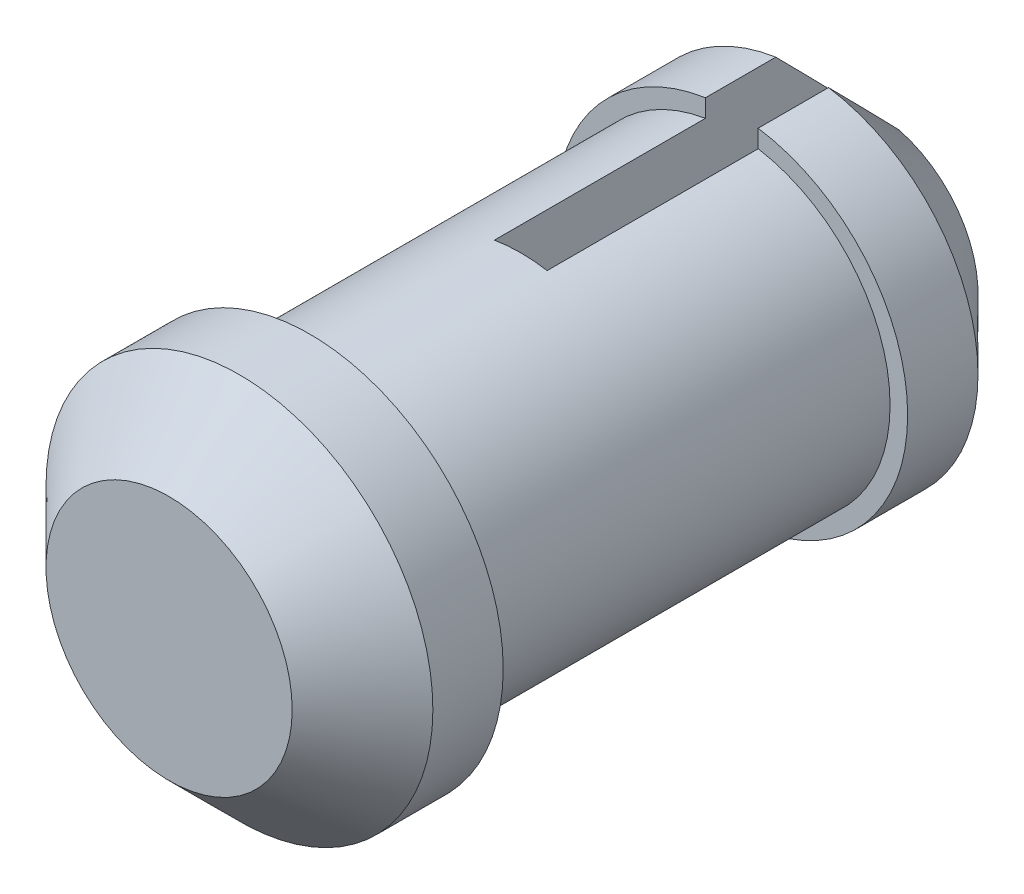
ISO-10303-21;
HEADER;
FILE_DESCRIPTION(('STEP AP214'),'2;1');
FILE_NAME('part.step','',(''),(''),'','','');
FILE_SCHEMA(('AUTOMOTIVE_DESIGN { 1 0 10303 214 1 1 1 1 }'));
ENDSEC;
DATA;
#1=APPLICATION_CONTEXT('core data for automotive mechanical design processes');
#2=APPLICATION_PROTOCOL_DEFINITION('international standard','automotive_design',2000,#1);
#3=PRODUCT_CONTEXT('',#1,'mechanical');
#4=PRODUCT('Part','Part','',(#3));
#5=PRODUCT_RELATED_PRODUCT_CATEGORY('part','',(#4));
#6=PRODUCT_DEFINITION_FORMATION('','',#4);
#7=PRODUCT_DEFINITION_CONTEXT('part definition',#1,'design');
#8=PRODUCT_DEFINITION('design','',#6,#7);
#9=PRODUCT_DEFINITION_SHAPE('','',#8);
#10=(LENGTH_UNIT() NAMED_UNIT(*) SI_UNIT(.MILLI.,.METRE.));
#11=(NAMED_UNIT(*) PLANE_ANGLE_UNIT() SI_UNIT($,.RADIAN.));
#12=(NAMED_UNIT(*) SI_UNIT($,.STERADIAN.) SOLID_ANGLE_UNIT());
#13=UNCERTAINTY_MEASURE_WITH_UNIT(LENGTH_MEASURE(1.E-05),#10,'distance_accuracy_value','');
#14=(GEOMETRIC_REPRESENTATION_CONTEXT(3) GLOBAL_UNCERTAINTY_ASSIGNED_CONTEXT((#13)) GLOBAL_UNIT_ASSIGNED_CONTEXT((#10,
#11,#12)) REPRESENTATION_CONTEXT('',''));
#15=CARTESIAN_POINT('',(0.,0.,0.));
#16=DIRECTION('',(0.,0.,1.));
#17=DIRECTION('',(1.,0.,0.));
#18=AXIS2_PLACEMENT_3D('',#15,#16,#17);
#19=CARTESIAN_POINT('',(0.,0.,-4.));
#20=DIRECTION('',(0.,0.,1.));
#21=DIRECTION('',(1.,0.,0.));
#22=AXIS2_PLACEMENT_3D('',#19,#20,#21);
#23=CYLINDRICAL_SURFACE('',#22,5.);
#24=DIRECTION('',(0.,0.,1.));
#25=VECTOR('',#24,1.);
#26=CARTESIAN_POINT('',(0.75,-4.9434299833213,-4.));
#27=LINE('',#26,#25);
#28=CARTESIAN_POINT('',(0.75,-4.9434299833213,0.));
#29=VERTEX_POINT('',#28);
#30=CARTESIAN_POINT('',(0.75,-4.9434299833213,-1.99999999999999));
#31=VERTEX_POINT('',#30);
#32=EDGE_CURVE('E157',#29,#31,#27,.F.);
#33=ORIENTED_EDGE('',*,*,#32,.T.);
#34=CARTESIAN_POINT('',(0.,0.,-1.99999999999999));
#35=DIRECTION('',(0.,0.,-1.));
#36=DIRECTION('',(-1.,0.,0.));
#37=AXIS2_PLACEMENT_3D('',#34,#35,#36);
#38=CIRCLE('',#37,5.);
#39=CARTESIAN_POINT('',(0.750000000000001,4.9434299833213,-1.99999999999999));
#40=VERTEX_POINT('',#39);
#41=EDGE_CURVE('E11',#31,#40,#38,.F.);
#42=ORIENTED_EDGE('',*,*,#41,.T.);
#43=DIRECTION('',(0.,0.,1.));
#44=VECTOR('',#43,1.);
#45=CARTESIAN_POINT('',(0.750000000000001,4.9434299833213,-4.));
#46=LINE('',#45,#44);
#47=CARTESIAN_POINT('',(0.750000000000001,4.9434299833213,0.));
#48=VERTEX_POINT('',#47);
#49=EDGE_CURVE('E169',#40,#48,#46,.T.);
#50=ORIENTED_EDGE('',*,*,#49,.T.);
#51=CARTESIAN_POINT('',(0.,0.,0.));
#52=DIRECTION('',(0.,0.,-1.));
#53=DIRECTION('',(-1.,0.,0.));
#54=AXIS2_PLACEMENT_3D('',#51,#52,#53);
#55=CIRCLE('',#54,5.);
#56=EDGE_CURVE('E184',#48,#29,#55,.T.);
#57=ORIENTED_EDGE('',*,*,#56,.T.);
#58=EDGE_LOOP('',(#33,#42,#50,#57));
#59=FACE_BOUND('',#58,.T.);
#60=ADVANCED_FACE('F47',(#59),#23,.T.);
#61=CARTESIAN_POINT('',(0.,0.,-4.));
#62=DIRECTION('',(0.,0.,-1.));
#63=DIRECTION('',(-1.,0.,0.));
#64=AXIS2_PLACEMENT_3D('',#61,#62,#63);
#65=PLANE('',#64);
#66=DIRECTION('',(0.,-1.,0.));
#67=VECTOR('',#66,1.);
#68=CARTESIAN_POINT('',(0.750000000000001,5.30356443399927,-4.));
#69=LINE('',#68,#67);
#70=CARTESIAN_POINT('',(0.750000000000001,2.90473750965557,-4.));
#71=VERTEX_POINT('',#70);
#72=CARTESIAN_POINT('',(0.75,-2.90473750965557,-4.));
#73=VERTEX_POINT('',#72);
#74=EDGE_CURVE('E283',#71,#73,#69,.T.);
#75=ORIENTED_EDGE('',*,*,#74,.F.);
#76=CARTESIAN_POINT('',(0.,0.,-4.));
#77=DIRECTION('',(0.,0.,-1.));
#78=DIRECTION('',(-1.,0.,0.));
#79=AXIS2_PLACEMENT_3D('',#76,#77,#78);
#80=CIRCLE('',#79,3.);
#81=EDGE_CURVE('E257',#71,#73,#80,.T.);
#82=ORIENTED_EDGE('',*,*,#81,.T.);
#83=EDGE_LOOP('',(#75,#82));
#84=FACE_BOUND('',#83,.T.);
#85=ADVANCED_FACE('F310',(#84),#65,.T.);
#86=CARTESIAN_POINT('',(0.,0.,0.));
#87=DIRECTION('',(0.,0.,-1.));
#88=DIRECTION('',(-1.,0.,0.));
#89=AXIS2_PLACEMENT_3D('',#86,#87,#88);
#90=PLANE('',#89);
#91=ORIENTED_EDGE('',*,*,#56,.F.);
#92=DIRECTION('',(0.,-1.,0.));
#93=VECTOR('',#92,1.);
#94=CARTESIAN_POINT('',(0.750000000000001,0.,0.));
#95=LINE('',#94,#93);
#96=CARTESIAN_POINT('',(0.750000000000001,4.43705983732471,0.));
#97=VERTEX_POINT('',#96);
#98=EDGE_CURVE('E137',#48,#97,#95,.T.);
#99=ORIENTED_EDGE('',*,*,#98,.T.);
#100=CARTESIAN_POINT('',(0.,0.,0.));
#101=DIRECTION('',(0.,0.,1.));
#102=DIRECTION('',(1.,0.,0.));
#103=AXIS2_PLACEMENT_3D('',#100,#101,#102);
#104=CIRCLE('',#103,4.5);
#105=CARTESIAN_POINT('',(0.75,-4.43705983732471,0.));
#106=VERTEX_POINT('',#105);
#107=EDGE_CURVE('E190',#106,#97,#104,.T.);
#108=ORIENTED_EDGE('',*,*,#107,.F.);
#109=EDGE_CURVE('E197',#106,#29,#95,.T.);
#110=ORIENTED_EDGE('',*,*,#109,.T.);
#111=EDGE_LOOP('',(#91,#99,#108,#110));
#112=FACE_BOUND('',#111,.T.);
#113=ADVANCED_FACE('F299',(#112),#90,.F.);
#114=CARTESIAN_POINT('',(0.,0.,12.));
#115=DIRECTION('',(0.,0.,-1.));
#116=DIRECTION('',(-1.,0.,0.));
#117=AXIS2_PLACEMENT_3D('',#114,#115,#116);
#118=CYLINDRICAL_SURFACE('',#117,4.5);
#119=ORIENTED_EDGE('',*,*,#107,.T.);
#120=DIRECTION('',(0.,0.,-1.));
#121=VECTOR('',#120,1.);
#122=CARTESIAN_POINT('',(0.750000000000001,4.43705983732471,12.));
#123=LINE('',#122,#121);
#124=CARTESIAN_POINT('',(0.750000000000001,4.43705983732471,6.));
#125=VERTEX_POINT('',#124);
#126=EDGE_CURVE('E172',#97,#125,#123,.F.);
#127=ORIENTED_EDGE('',*,*,#126,.T.);
#128=CARTESIAN_POINT('',(0.,0.,6.));
#129=DIRECTION('',(0.,0.,-1.));
#130=DIRECTION('',(-1.,0.,0.));
#131=AXIS2_PLACEMENT_3D('',#128,#129,#130);
#132=CIRCLE('',#131,4.5);
#133=CARTESIAN_POINT('',(-0.750000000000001,4.43705983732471,6.));
#134=VERTEX_POINT('',#133);
#135=EDGE_CURVE('E136',#134,#125,#132,.T.);
#136=ORIENTED_EDGE('',*,*,#135,.F.);
#137=DIRECTION('',(0.,0.,-1.));
#138=VECTOR('',#137,1.);
#139=CARTESIAN_POINT('',(-0.750000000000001,4.43705983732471,12.));
#140=LINE('',#139,#138);
#141=CARTESIAN_POINT('',(-0.750000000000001,4.43705983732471,0.));
#142=VERTEX_POINT('',#141);
#143=EDGE_CURVE('E146',#134,#142,#140,.T.);
#144=ORIENTED_EDGE('',*,*,#143,.T.);
#145=CARTESIAN_POINT('',(-0.75,-4.43705983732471,0.));
#146=VERTEX_POINT('',#145);
#147=EDGE_CURVE('E155',#142,#146,#104,.T.);
#148=ORIENTED_EDGE('',*,*,#147,.T.);
#149=DIRECTION('',(0.,0.,-1.));
#150=VECTOR('',#149,1.);
#151=CARTESIAN_POINT('',(-0.75,-4.43705983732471,12.));
#152=LINE('',#151,#150);
#153=CARTESIAN_POINT('',(-0.75,-4.43705983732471,6.));
#154=VERTEX_POINT('',#153);
#155=EDGE_CURVE('E143',#146,#154,#152,.F.);
#156=ORIENTED_EDGE('',*,*,#155,.T.);
#157=CARTESIAN_POINT('',(0.75,-4.43705983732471,6.));
#158=VERTEX_POINT('',#157);
#159=EDGE_CURVE('E125',#158,#154,#132,.T.);
#160=ORIENTED_EDGE('',*,*,#159,.F.);
#161=DIRECTION('',(0.,0.,-1.));
#162=VECTOR('',#161,1.);
#163=CARTESIAN_POINT('',(0.75,-4.43705983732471,12.));
#164=LINE('',#163,#162);
#165=EDGE_CURVE('E162',#158,#106,#164,.T.);
#166=ORIENTED_EDGE('',*,*,#165,.T.);
#167=EDGE_LOOP('',(#119,#127,#136,#144,#148,#156,#160,#166));
#168=FACE_BOUND('',#167,.T.);
#169=CARTESIAN_POINT('',(0.,0.,12.));
#170=DIRECTION('',(0.,0.,1.));
#171=DIRECTION('',(1.,0.,0.));
#172=AXIS2_PLACEMENT_3D('',#169,#170,#171);
#173=CIRCLE('',#172,4.5);
#174=CARTESIAN_POINT('',(4.5,0.,12.));
#175=VERTEX_POINT('',#174);
#176=EDGE_CURVE('E185',#175,#175,#173,.T.);
#177=ORIENTED_EDGE('',*,*,#176,.F.);
#178=EDGE_LOOP('',(#177));
#179=FACE_BOUND('',#178,.T.);
#180=ADVANCED_FACE('F152',(#168,#179),#118,.T.);
#181=DIRECTION('',(0.,0.,1.));
#182=VECTOR('',#181,1.);
#183=CARTESIAN_POINT('',(-0.750000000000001,4.9434299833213,-4.));
#184=LINE('',#183,#182);
#185=CARTESIAN_POINT('',(-0.750000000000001,4.9434299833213,0.));
#186=VERTEX_POINT('',#185);
#187=CARTESIAN_POINT('',(-0.750000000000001,4.9434299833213,-1.99999999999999));
#188=VERTEX_POINT('',#187);
#189=EDGE_CURVE('E148',#186,#188,#184,.F.);
#190=ORIENTED_EDGE('',*,*,#189,.T.);
#191=CARTESIAN_POINT('',(0.,0.,-1.99999999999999));
#192=DIRECTION('',(0.,0.,-1.));
#193=DIRECTION('',(-1.,0.,0.));
#194=AXIS2_PLACEMENT_3D('',#191,#192,#193);
#195=CIRCLE('',#194,5.);
#196=CARTESIAN_POINT('',(-0.75,-4.9434299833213,-1.99999999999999));
#197=VERTEX_POINT('',#196);
#198=EDGE_CURVE('E262',#188,#197,#195,.F.);
#199=ORIENTED_EDGE('',*,*,#198,.T.);
#200=DIRECTION('',(0.,0.,1.));
#201=VECTOR('',#200,1.);
#202=CARTESIAN_POINT('',(-0.75,-4.9434299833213,-4.));
#203=LINE('',#202,#201);
#204=CARTESIAN_POINT('',(-0.75,-4.9434299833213,0.));
#205=VERTEX_POINT('',#204);
#206=EDGE_CURVE('E158',#197,#205,#203,.T.);
#207=ORIENTED_EDGE('',*,*,#206,.T.);
#208=EDGE_CURVE('E180',#205,#186,#55,.T.);
#209=ORIENTED_EDGE('',*,*,#208,.T.);
#210=EDGE_LOOP('',(#190,#199,#207,#209));
#211=FACE_BOUND('',#210,.T.);
#212=ADVANCED_FACE('F275',(#211),#23,.T.);
#213=DIRECTION('',(0.,1.,0.));
#214=VECTOR('',#213,1.);
#215=CARTESIAN_POINT('',(-0.750000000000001,5.30356443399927,-4.));
#216=LINE('',#215,#214);
#217=CARTESIAN_POINT('',(-0.75,-2.90473750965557,-4.));
#218=VERTEX_POINT('',#217);
#219=CARTESIAN_POINT('',(-0.750000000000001,2.90473750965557,-4.));
#220=VERTEX_POINT('',#219);
#221=EDGE_CURVE('E272',#218,#220,#216,.T.);
#222=ORIENTED_EDGE('',*,*,#221,.F.);
#223=CARTESIAN_POINT('',(0.,0.,-4.));
#224=DIRECTION('',(0.,0.,-1.));
#225=DIRECTION('',(-1.,0.,0.));
#226=AXIS2_PLACEMENT_3D('',#223,#224,#225);
#227=CIRCLE('',#226,3.);
#228=EDGE_CURVE('E209',#218,#220,#227,.T.);
#229=ORIENTED_EDGE('',*,*,#228,.T.);
#230=EDGE_LOOP('',(#222,#229));
#231=FACE_BOUND('',#230,.T.);
#232=ADVANCED_FACE('F281',(#231),#65,.T.);
#233=ORIENTED_EDGE('',*,*,#208,.F.);
#234=DIRECTION('',(0.,1.,0.));
#235=VECTOR('',#234,1.);
#236=CARTESIAN_POINT('',(-0.750000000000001,0.,0.));
#237=LINE('',#236,#235);
#238=EDGE_CURVE('E196',#205,#146,#237,.T.);
#239=ORIENTED_EDGE('',*,*,#238,.T.);
#240=ORIENTED_EDGE('',*,*,#147,.F.);
#241=EDGE_CURVE('E189',#142,#186,#237,.T.);
#242=ORIENTED_EDGE('',*,*,#241,.T.);
#243=EDGE_LOOP('',(#233,#239,#240,#242));
#244=FACE_BOUND('',#243,.T.);
#245=ADVANCED_FACE('F291',(#244),#90,.F.);
#246=CARTESIAN_POINT('',(0.,0.,16.));
#247=DIRECTION('',(0.,0.,-1.));
#248=DIRECTION('',(-1.,0.,0.));
#249=AXIS2_PLACEMENT_3D('',#246,#247,#248);
#250=CYLINDRICAL_SURFACE('',#249,5.5);
#251=CARTESIAN_POINT('',(0.,0.,14.));
#252=DIRECTION('',(0.,0.,1.));
#253=DIRECTION('',(1.,0.,0.));
#254=AXIS2_PLACEMENT_3D('',#251,#252,#253);
#255=CIRCLE('',#254,5.5);
#256=CARTESIAN_POINT('',(5.5,0.,14.));
#257=VERTEX_POINT('',#256);
#258=EDGE_CURVE('E205',#257,#257,#255,.F.);
#259=ORIENTED_EDGE('',*,*,#258,.T.);
#260=EDGE_LOOP('',(#259));
#261=FACE_BOUND('',#260,.T.);
#262=CARTESIAN_POINT('',(0.,0.,12.));
#263=DIRECTION('',(0.,0.,1.));
#264=DIRECTION('',(1.,0.,0.));
#265=AXIS2_PLACEMENT_3D('',#262,#263,#264);
#266=CIRCLE('',#265,5.5);
#267=CARTESIAN_POINT('',(5.5,0.,12.));
#268=VERTEX_POINT('',#267);
#269=EDGE_CURVE('E176',#268,#268,#266,.T.);
#270=ORIENTED_EDGE('',*,*,#269,.T.);
#271=EDGE_LOOP('',(#270));
#272=FACE_BOUND('',#271,.T.);
#273=ADVANCED_FACE('F341',(#261,#272),#250,.T.);
#274=CARTESIAN_POINT('',(0.,0.,16.));
#275=DIRECTION('',(0.,0.,1.));
#276=DIRECTION('',(1.,0.,0.));
#277=AXIS2_PLACEMENT_3D('',#274,#275,#276);
#278=PLANE('',#277);
#279=CARTESIAN_POINT('',(0.,0.,16.));
#280=DIRECTION('',(0.,0.,1.));
#281=DIRECTION('',(1.,0.,0.));
#282=AXIS2_PLACEMENT_3D('',#279,#280,#281);
#283=CIRCLE('',#282,3.5);
#284=CARTESIAN_POINT('',(3.5,0.,16.));
#285=VERTEX_POINT('',#284);
#286=EDGE_CURVE('E201',#285,#285,#283,.T.);
#287=ORIENTED_EDGE('',*,*,#286,.T.);
#288=EDGE_LOOP('',(#287));
#289=FACE_BOUND('',#288,.T.);
#290=ADVANCED_FACE('F241',(#289),#278,.T.);
#291=CARTESIAN_POINT('',(0.,0.,12.));
#292=DIRECTION('',(0.,0.,1.));
#293=DIRECTION('',(1.,0.,0.));
#294=AXIS2_PLACEMENT_3D('',#291,#292,#293);
#295=PLANE('',#294);
#296=ORIENTED_EDGE('',*,*,#176,.T.);
#297=EDGE_LOOP('',(#296));
#298=FACE_BOUND('',#297,.T.);
#299=ORIENTED_EDGE('',*,*,#269,.F.);
#300=EDGE_LOOP('',(#299));
#301=FACE_BOUND('',#300,.T.);
#302=ADVANCED_FACE('F340',(#298,#301),#295,.F.);
#303=CARTESIAN_POINT('',(0.,0.,6.));
#304=DIRECTION('',(0.,0.,-1.));
#305=DIRECTION('',(-1.,0.,0.));
#306=AXIS2_PLACEMENT_3D('',#303,#304,#305);
#307=PLANE('',#306);
#308=ORIENTED_EDGE('',*,*,#135,.T.);
#309=DIRECTION('',(0.,-1.,0.));
#310=VECTOR('',#309,1.);
#311=CARTESIAN_POINT('',(0.750000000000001,5.30356443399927,6.));
#312=LINE('',#311,#310);
#313=EDGE_CURVE('E131',#125,#158,#312,.T.);
#314=ORIENTED_EDGE('',*,*,#313,.T.);
#315=ORIENTED_EDGE('',*,*,#159,.T.);
#316=DIRECTION('',(0.,1.,0.));
#317=VECTOR('',#316,1.);
#318=CARTESIAN_POINT('',(-0.750000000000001,5.30356443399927,6.));
#319=LINE('',#318,#317);
#320=EDGE_CURVE('E128',#154,#134,#319,.T.);
#321=ORIENTED_EDGE('',*,*,#320,.T.);
#322=EDGE_LOOP('',(#308,#314,#315,#321));
#323=FACE_BOUND('',#322,.T.);
#324=ADVANCED_FACE('F127',(#323),#307,.T.);
#325=CARTESIAN_POINT('',(0.750000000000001,5.30356443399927,6.));
#326=DIRECTION('',(1.,0.,0.));
#327=DIRECTION('',(0.,1.,0.));
#328=AXIS2_PLACEMENT_3D('',#325,#326,#327);
#329=PLANE('',#328);
#330=ORIENTED_EDGE('',*,*,#74,.T.);
#331=CARTESIAN_POINT('',(0.75,-2.90473750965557,-4.));
#332=CARTESIAN_POINT('',(0.75,-3.07569200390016,-3.83441999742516));
#333=CARTESIAN_POINT('',(0.75,-3.24624642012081,-3.66842878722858));
#334=CARTESIAN_POINT('',(0.75,-3.58677057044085,-3.33584957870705));
#335=CARTESIAN_POINT('',(0.75,-3.75674030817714,-3.16926158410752));
#336=CARTESIAN_POINT('',(0.75,-4.09631200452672,-2.8357130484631));
#337=CARTESIAN_POINT('',(0.75,-4.26591396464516,-2.66875250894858));
#338=CARTESIAN_POINT('',(0.75,-4.60484930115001,-2.33455693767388));
#339=CARTESIAN_POINT('',(0.75,-4.77418267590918,-2.16732190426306));
#340=CARTESIAN_POINT('',(0.75,-4.9434299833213,-1.99999999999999));
#341=B_SPLINE_CURVE_WITH_KNOTS('',3,(#331,#332,#333,#334,#335,#336,#337,#338,#339,#340),
.UNSPECIFIED.,.F.,.F.,(4,2,2,2,4),(0.,0.713985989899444,1.42796753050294,2.14194614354,
2.85592906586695),.UNSPECIFIED.);
#342=EDGE_CURVE('E58',#73,#31,#341,.T.);
#343=ORIENTED_EDGE('',*,*,#342,.T.);
#344=ORIENTED_EDGE('',*,*,#32,.F.);
#345=ORIENTED_EDGE('',*,*,#109,.F.);
#346=ORIENTED_EDGE('',*,*,#165,.F.);
#347=ORIENTED_EDGE('',*,*,#313,.F.);
#348=ORIENTED_EDGE('',*,*,#126,.F.);
#349=ORIENTED_EDGE('',*,*,#98,.F.);
#350=ORIENTED_EDGE('',*,*,#49,.F.);
#351=CARTESIAN_POINT('',(0.750000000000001,4.9434299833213,-1.99999999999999));
#352=CARTESIAN_POINT('',(0.750000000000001,4.77418267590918,-2.16732190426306));
#353=CARTESIAN_POINT('',(0.750000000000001,4.60484930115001,-2.33455693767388));
#354=CARTESIAN_POINT('',(0.750000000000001,4.26591396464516,-2.66875250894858));
#355=CARTESIAN_POINT('',(0.750000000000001,4.09631200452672,-2.8357130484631));
#356=CARTESIAN_POINT('',(0.750000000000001,3.75674030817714,-3.16926158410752));
#357=CARTESIAN_POINT('',(0.750000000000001,3.58677057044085,-3.33584957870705));
#358=CARTESIAN_POINT('',(0.750000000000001,3.24624642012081,-3.66842878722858));
#359=CARTESIAN_POINT('',(0.750000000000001,3.07569200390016,-3.83441999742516));
#360=CARTESIAN_POINT('',(0.750000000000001,2.90473750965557,-4.));
#361=B_SPLINE_CURVE_WITH_KNOTS('',3,(#351,#352,#353,#354,#355,#356,#357,#358,#359,#360),
.UNSPECIFIED.,.F.,.F.,(4,2,2,2,4),(0.,0.713982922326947,1.42796153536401,2.14194307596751,
2.85592906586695),.UNSPECIFIED.);
#362=EDGE_CURVE('E245',#40,#71,#361,.T.);
#363=ORIENTED_EDGE('',*,*,#362,.T.);
#364=EDGE_LOOP('',(#330,#343,#344,#345,#346,#347,#348,#349,#350,#363));
#365=FACE_BOUND('',#364,.T.);
#366=ADVANCED_FACE('F236',(#365),#329,.F.);
#367=CARTESIAN_POINT('',(-0.750000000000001,5.30356443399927,6.));
#368=DIRECTION('',(-1.,0.,0.));
#369=DIRECTION('',(0.,-1.,0.));
#370=AXIS2_PLACEMENT_3D('',#367,#368,#369);
#371=PLANE('',#370);
#372=ORIENTED_EDGE('',*,*,#221,.T.);
#373=CARTESIAN_POINT('',(-0.750000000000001,2.90473750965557,-4.));
#374=CARTESIAN_POINT('',(-0.750000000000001,3.07569200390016,-3.83441999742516));
#375=CARTESIAN_POINT('',(-0.750000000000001,3.24624642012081,-3.66842878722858));
#376=CARTESIAN_POINT('',(-0.750000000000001,3.58677057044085,-3.33584957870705));
#377=CARTESIAN_POINT('',(-0.750000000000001,3.75674030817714,-3.16926158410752));
#378=CARTESIAN_POINT('',(-0.750000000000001,4.09631200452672,-2.8357130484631));
#379=CARTESIAN_POINT('',(-0.750000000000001,4.26591396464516,-2.66875250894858));
#380=CARTESIAN_POINT('',(-0.750000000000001,4.60484930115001,-2.33455693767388));
#381=CARTESIAN_POINT('',(-0.750000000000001,4.77418267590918,-2.16732190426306));
#382=CARTESIAN_POINT('',(-0.750000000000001,4.9434299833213,-1.99999999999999));
#383=B_SPLINE_CURVE_WITH_KNOTS('',3,(#373,#374,#375,#376,#377,#378,#379,#380,#381,#382),
.UNSPECIFIED.,.F.,.F.,(4,2,2,2,4),(0.,0.713985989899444,1.42796753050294,2.14194614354,
2.85592906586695),.UNSPECIFIED.);
#384=EDGE_CURVE('E221',#220,#188,#383,.T.);
#385=ORIENTED_EDGE('',*,*,#384,.T.);
#386=ORIENTED_EDGE('',*,*,#189,.F.);
#387=ORIENTED_EDGE('',*,*,#241,.F.);
#388=ORIENTED_EDGE('',*,*,#143,.F.);
#389=ORIENTED_EDGE('',*,*,#320,.F.);
#390=ORIENTED_EDGE('',*,*,#155,.F.);
#391=ORIENTED_EDGE('',*,*,#238,.F.);
#392=ORIENTED_EDGE('',*,*,#206,.F.);
#393=CARTESIAN_POINT('',(-0.75,-4.9434299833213,-1.99999999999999));
#394=CARTESIAN_POINT('',(-0.75,-4.77418267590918,-2.16732190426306));
#395=CARTESIAN_POINT('',(-0.75,-4.60484930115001,-2.33455693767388));
#396=CARTESIAN_POINT('',(-0.75,-4.26591396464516,-2.66875250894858));
#397=CARTESIAN_POINT('',(-0.75,-4.09631200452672,-2.8357130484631));
#398=CARTESIAN_POINT('',(-0.75,-3.75674030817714,-3.16926158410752));
#399=CARTESIAN_POINT('',(-0.75,-3.58677057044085,-3.33584957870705));
#400=CARTESIAN_POINT('',(-0.75,-3.24624642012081,-3.66842878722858));
#401=CARTESIAN_POINT('',(-0.75,-3.07569200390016,-3.83441999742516));
#402=CARTESIAN_POINT('',(-0.75,-2.90473750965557,-4.));
#403=B_SPLINE_CURVE_WITH_KNOTS('',3,(#393,#394,#395,#396,#397,#398,#399,#400,#401,#402),
.UNSPECIFIED.,.F.,.F.,(4,2,2,2,4),(0.,0.713982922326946,1.42796153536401,2.14194307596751,
2.85592906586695),.UNSPECIFIED.);
#404=EDGE_CURVE('E213',#197,#218,#403,.T.);
#405=ORIENTED_EDGE('',*,*,#404,.T.);
#406=EDGE_LOOP('',(#372,#385,#386,#387,#388,#389,#390,#391,#392,#405));
#407=FACE_BOUND('',#406,.T.);
#408=ADVANCED_FACE('F141',(#407),#371,.F.);
#409=CARTESIAN_POINT('',(0.,0.,16.));
#410=DIRECTION('',(0.,0.,-1.));
#411=DIRECTION('',(-1.,0.,0.));
#412=AXIS2_PLACEMENT_3D('',#409,#410,#411);
#413=CONICAL_SURFACE('',#412,3.5,0.785398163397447);
#414=ORIENTED_EDGE('',*,*,#258,.F.);
#415=EDGE_LOOP('',(#414));
#416=FACE_BOUND('',#415,.T.);
#417=ORIENTED_EDGE('',*,*,#286,.F.);
#418=EDGE_LOOP('',(#417));
#419=FACE_BOUND('',#418,.T.);
#420=ADVANCED_FACE('F235',(#416,#419),#413,.T.);
#421=CARTESIAN_POINT('',(0.,0.,-4.));
#422=DIRECTION('',(0.,0.,1.));
#423=DIRECTION('',(1.,0.,0.));
#424=AXIS2_PLACEMENT_3D('',#421,#422,#423);
#425=CONICAL_SURFACE('',#424,3.,0.785398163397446);
#426=ORIENTED_EDGE('',*,*,#404,.F.);
#427=ORIENTED_EDGE('',*,*,#198,.F.);
#428=ORIENTED_EDGE('',*,*,#384,.F.);
#429=ORIENTED_EDGE('',*,*,#228,.F.);
#430=EDGE_LOOP('',(#426,#427,#428,#429));
#431=FACE_BOUND('',#430,.T.);
#432=ADVANCED_FACE('F228',(#431),#425,.T.);
#433=CARTESIAN_POINT('',(0.,0.,-4.));
#434=DIRECTION('',(0.,0.,1.));
#435=DIRECTION('',(1.,0.,0.));
#436=AXIS2_PLACEMENT_3D('',#433,#434,#435);
#437=CONICAL_SURFACE('',#436,3.,0.785398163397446);
#438=ORIENTED_EDGE('',*,*,#362,.F.);
#439=ORIENTED_EDGE('',*,*,#41,.F.);
#440=ORIENTED_EDGE('',*,*,#342,.F.);
#441=ORIENTED_EDGE('',*,*,#81,.F.);
#442=EDGE_LOOP('',(#438,#439,#440,#441));
#443=FACE_BOUND('',#442,.T.);
#444=ADVANCED_FACE('F50',(#443),#437,.T.);
#445=CLOSED_SHELL('',(#60,#85,#113,#180,#212,#232,#245,#273,#290,#302,#324,#366,#408,#420,#432,#444));
#446=MANIFOLD_SOLID_BREP('B2',#445);
#447=ADVANCED_BREP_SHAPE_REPRESENTATION('',(#18,#446),#14);
#448=SHAPE_DEFINITION_REPRESENTATION(#9,#447);
ENDSEC;
END-ISO-10303-21;
